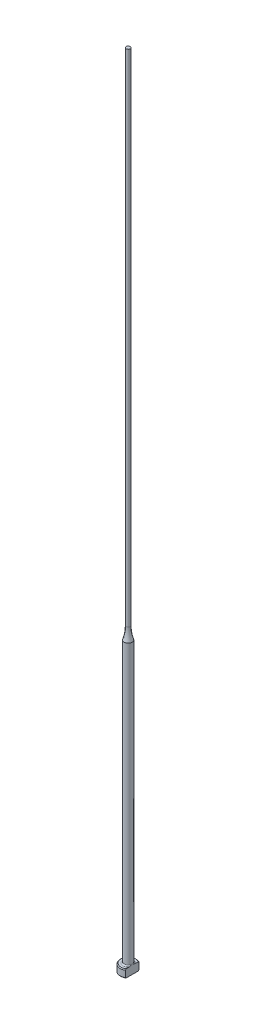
from build123d import *
from build123d.topology import SkipClean

# Parameters (mm, degrees)
CHAMFER1_SIZE = 0.2
FILLET1_R     = 0.3
KEY_DEPTH     = 201.019999


with BuildPart() as part:
    # Sketch1 → Revolve1 (revolve)
    with BuildSketch(Plane.XY, mode=Mode.PRIVATE) as revolve1_sk:
        with BuildLine():
            Line((0, 0), (-2, 0))
            Line((-2, 0), (-2, 2))
            Line((-2, 2), (-1, 2))
            Line((-1, 2), (-1, 71.877501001))
            ThreePointArc((-1, 71.877501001), (-0.625791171, 73.41886117), (-0.5, 75))
            Line((-0.5, 75), (-0.5, 200))
            Line((-0.5, 200), (0, 200))
            Line((0, 200), (0, 0))
        make_face()
    revolve(revolve1_sk.sketch.rotate(Axis((0, 259.958771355, 0), (0, -1, 0)), 270), axis=Axis((0, 259.958771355, 0), (0, -1, 0)))

    # Chamfer1
    chamfer1_edges = [part.edges().sort_by_distance(p)[0] for p in [
        (0, 0, -2),
        (0, 2, -2),
    ]]
    chamfer(chamfer1_edges, length=CHAMFER1_SIZE)

    # Fillet1
    fillet1_edges = [part.edges().sort_by_distance(p)[0] for p in [
        (0, 2, -1),
    ]]
    fillet(fillet1_edges, radius=FILLET1_R)

    # Sketch2 → KEY (cut, through all)
    with SkipClean():  # the faces are left unmerged after this step: merging them gives an invalid solid
        with BuildSketch(Plane(origin=(0, 0, 0), x_dir=(1, 0, 0), z_dir=(0, 1, 0))):
            with BuildLine():
                Line((1, 1.732050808), (1, -1.732050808))
                ThreePointArc((1, -1.732050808), (2, 0), (1, 1.732050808))
            make_face()
        extrude(amount=KEY_DEPTH, mode=Mode.SUBTRACT)


solid = part.part
